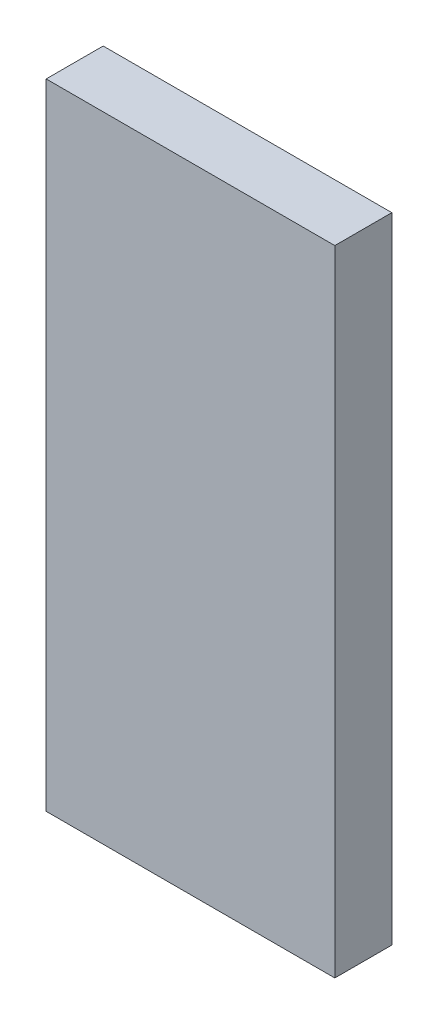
ISO-10303-21;
HEADER;
FILE_DESCRIPTION(('STEP AP214'),'2;1');
FILE_NAME('part.step','',(''),(''),'','','');
FILE_SCHEMA(('AUTOMOTIVE_DESIGN { 1 0 10303 214 1 1 1 1 }'));
ENDSEC;
DATA;
#1=APPLICATION_CONTEXT('core data for automotive mechanical design processes');
#2=APPLICATION_PROTOCOL_DEFINITION('international standard','automotive_design',2000,#1);
#3=PRODUCT_CONTEXT('',#1,'mechanical');
#4=PRODUCT('Part','Part','',(#3));
#5=PRODUCT_RELATED_PRODUCT_CATEGORY('part','',(#4));
#6=PRODUCT_DEFINITION_FORMATION('','',#4);
#7=PRODUCT_DEFINITION_CONTEXT('part definition',#1,'design');
#8=PRODUCT_DEFINITION('design','',#6,#7);
#9=PRODUCT_DEFINITION_SHAPE('','',#8);
#10=(LENGTH_UNIT() NAMED_UNIT(*) SI_UNIT(.MILLI.,.METRE.));
#11=(NAMED_UNIT(*) PLANE_ANGLE_UNIT() SI_UNIT($,.RADIAN.));
#12=(NAMED_UNIT(*) SI_UNIT($,.STERADIAN.) SOLID_ANGLE_UNIT());
#13=UNCERTAINTY_MEASURE_WITH_UNIT(LENGTH_MEASURE(1.E-05),#10,'distance_accuracy_value','');
#14=(GEOMETRIC_REPRESENTATION_CONTEXT(3) GLOBAL_UNCERTAINTY_ASSIGNED_CONTEXT((#13)) GLOBAL_UNIT_ASSIGNED_CONTEXT((#10,
#11,#12)) REPRESENTATION_CONTEXT('',''));
#15=CARTESIAN_POINT('',(0.,0.,0.));
#16=DIRECTION('',(0.,0.,1.));
#17=DIRECTION('',(1.,0.,0.));
#18=AXIS2_PLACEMENT_3D('',#15,#16,#17);
#19=CARTESIAN_POINT('',(0.,0.,8.));
#20=DIRECTION('',(1.,0.,0.));
#21=DIRECTION('',(0.,0.,-1.));
#22=AXIS2_PLACEMENT_3D('',#19,#20,#21);
#23=PLANE('',#22);
#24=DIRECTION('',(0.,-1.,0.));
#25=VECTOR('',#24,1.);
#26=CARTESIAN_POINT('',(0.,0.,0.));
#27=LINE('',#26,#25);
#28=CARTESIAN_POINT('',(0.,89.,0.));
#29=VERTEX_POINT('',#28);
#30=CARTESIAN_POINT('',(0.,0.,0.));
#31=VERTEX_POINT('',#30);
#32=EDGE_CURVE('E93',#29,#31,#27,.T.);
#33=ORIENTED_EDGE('',*,*,#32,.T.);
#34=DIRECTION('',(0.,0.,-1.));
#35=VECTOR('',#34,1.);
#36=CARTESIAN_POINT('',(0.,0.,8.));
#37=LINE('',#36,#35);
#38=CARTESIAN_POINT('',(0.,0.,8.));
#39=VERTEX_POINT('',#38);
#40=EDGE_CURVE('E11',#39,#31,#37,.T.);
#41=ORIENTED_EDGE('',*,*,#40,.F.);
#42=DIRECTION('',(0.,-1.,0.));
#43=VECTOR('',#42,1.);
#44=CARTESIAN_POINT('',(0.,0.,8.));
#45=LINE('',#44,#43);
#46=CARTESIAN_POINT('',(0.,89.,8.));
#47=VERTEX_POINT('',#46);
#48=EDGE_CURVE('E81',#47,#39,#45,.T.);
#49=ORIENTED_EDGE('',*,*,#48,.F.);
#50=DIRECTION('',(0.,0.,-1.));
#51=VECTOR('',#50,1.);
#52=CARTESIAN_POINT('',(0.,89.,8.));
#53=LINE('',#52,#51);
#54=EDGE_CURVE('E89',#47,#29,#53,.T.);
#55=ORIENTED_EDGE('',*,*,#54,.T.);
#56=EDGE_LOOP('',(#33,#41,#49,#55));
#57=FACE_BOUND('',#56,.T.);
#58=ADVANCED_FACE('F30',(#57),#23,.F.);
#59=CARTESIAN_POINT('',(0.,0.,8.));
#60=DIRECTION('',(0.,1.,0.));
#61=DIRECTION('',(0.,0.,1.));
#62=AXIS2_PLACEMENT_3D('',#59,#60,#61);
#63=PLANE('',#62);
#64=DIRECTION('',(1.,0.,0.));
#65=VECTOR('',#64,1.);
#66=CARTESIAN_POINT('',(0.,0.,0.));
#67=LINE('',#66,#65);
#68=CARTESIAN_POINT('',(40.5,0.,0.));
#69=VERTEX_POINT('',#68);
#70=EDGE_CURVE('E85',#31,#69,#67,.T.);
#71=ORIENTED_EDGE('',*,*,#70,.T.);
#72=DIRECTION('',(0.,0.,-1.));
#73=VECTOR('',#72,1.);
#74=CARTESIAN_POINT('',(40.5,0.,8.));
#75=LINE('',#74,#73);
#76=CARTESIAN_POINT('',(40.5,0.,8.));
#77=VERTEX_POINT('',#76);
#78=EDGE_CURVE('E38',#77,#69,#75,.T.);
#79=ORIENTED_EDGE('',*,*,#78,.F.);
#80=DIRECTION('',(1.,0.,0.));
#81=VECTOR('',#80,1.);
#82=CARTESIAN_POINT('',(0.,0.,8.));
#83=LINE('',#82,#81);
#84=EDGE_CURVE('E76',#39,#77,#83,.T.);
#85=ORIENTED_EDGE('',*,*,#84,.F.);
#86=ORIENTED_EDGE('',*,*,#40,.T.);
#87=EDGE_LOOP('',(#71,#79,#85,#86));
#88=FACE_BOUND('',#87,.T.);
#89=ADVANCED_FACE('F84',(#88),#63,.F.);
#90=CARTESIAN_POINT('',(40.5,0.,8.));
#91=DIRECTION('',(-1.,0.,0.));
#92=DIRECTION('',(0.,0.,1.));
#93=AXIS2_PLACEMENT_3D('',#90,#91,#92);
#94=PLANE('',#93);
#95=DIRECTION('',(0.,1.,0.));
#96=VECTOR('',#95,1.);
#97=CARTESIAN_POINT('',(40.5,0.,0.));
#98=LINE('',#97,#96);
#99=CARTESIAN_POINT('',(40.5,89.,0.));
#100=VERTEX_POINT('',#99);
#101=EDGE_CURVE('E63',#69,#100,#98,.T.);
#102=ORIENTED_EDGE('',*,*,#101,.T.);
#103=DIRECTION('',(0.,0.,-1.));
#104=VECTOR('',#103,1.);
#105=CARTESIAN_POINT('',(40.5,89.,8.));
#106=LINE('',#105,#104);
#107=CARTESIAN_POINT('',(40.5,89.,8.));
#108=VERTEX_POINT('',#107);
#109=EDGE_CURVE('E86',#108,#100,#106,.T.);
#110=ORIENTED_EDGE('',*,*,#109,.F.);
#111=DIRECTION('',(0.,1.,0.));
#112=VECTOR('',#111,1.);
#113=CARTESIAN_POINT('',(40.5,0.,8.));
#114=LINE('',#113,#112);
#115=EDGE_CURVE('E79',#77,#108,#114,.T.);
#116=ORIENTED_EDGE('',*,*,#115,.F.);
#117=ORIENTED_EDGE('',*,*,#78,.T.);
#118=EDGE_LOOP('',(#102,#110,#116,#117));
#119=FACE_BOUND('',#118,.T.);
#120=ADVANCED_FACE('F87',(#119),#94,.F.);
#121=CARTESIAN_POINT('',(0.,89.,8.));
#122=DIRECTION('',(0.,-1.,0.));
#123=DIRECTION('',(0.,0.,-1.));
#124=AXIS2_PLACEMENT_3D('',#121,#122,#123);
#125=PLANE('',#124);
#126=DIRECTION('',(-1.,0.,0.));
#127=VECTOR('',#126,1.);
#128=CARTESIAN_POINT('',(0.,89.,0.));
#129=LINE('',#128,#127);
#130=EDGE_CURVE('E69',#100,#29,#129,.T.);
#131=ORIENTED_EDGE('',*,*,#130,.T.);
#132=ORIENTED_EDGE('',*,*,#54,.F.);
#133=DIRECTION('',(-1.,0.,0.));
#134=VECTOR('',#133,1.);
#135=CARTESIAN_POINT('',(0.,89.,8.));
#136=LINE('',#135,#134);
#137=EDGE_CURVE('E46',#108,#47,#136,.T.);
#138=ORIENTED_EDGE('',*,*,#137,.F.);
#139=ORIENTED_EDGE('',*,*,#109,.T.);
#140=EDGE_LOOP('',(#131,#132,#138,#139));
#141=FACE_BOUND('',#140,.T.);
#142=ADVANCED_FACE('F100',(#141),#125,.F.);
#143=CARTESIAN_POINT('',(0.,89.,8.));
#144=DIRECTION('',(0.,0.,-1.));
#145=DIRECTION('',(-1.,0.,0.));
#146=AXIS2_PLACEMENT_3D('',#143,#144,#145);
#147=PLANE('',#146);
#148=ORIENTED_EDGE('',*,*,#48,.T.);
#149=ORIENTED_EDGE('',*,*,#84,.T.);
#150=ORIENTED_EDGE('',*,*,#115,.T.);
#151=ORIENTED_EDGE('',*,*,#137,.T.);
#152=EDGE_LOOP('',(#148,#149,#150,#151));
#153=FACE_BOUND('',#152,.T.);
#154=ADVANCED_FACE('F77',(#153),#147,.F.);
#155=CARTESIAN_POINT('',(0.,89.,0.));
#156=DIRECTION('',(0.,0.,-1.));
#157=DIRECTION('',(-1.,0.,0.));
#158=AXIS2_PLACEMENT_3D('',#155,#156,#157);
#159=PLANE('',#158);
#160=ORIENTED_EDGE('',*,*,#32,.F.);
#161=ORIENTED_EDGE('',*,*,#130,.F.);
#162=ORIENTED_EDGE('',*,*,#101,.F.);
#163=ORIENTED_EDGE('',*,*,#70,.F.);
#164=EDGE_LOOP('',(#160,#161,#162,#163));
#165=FACE_BOUND('',#164,.T.);
#166=ADVANCED_FACE('F103',(#165),#159,.T.);
#167=CLOSED_SHELL('',(#58,#89,#120,#142,#154,#166));
#168=MANIFOLD_SOLID_BREP('B2',#167);
#169=ADVANCED_BREP_SHAPE_REPRESENTATION('',(#18,#168),#14);
#170=SHAPE_DEFINITION_REPRESENTATION(#9,#169);
ENDSEC;
END-ISO-10303-21;
